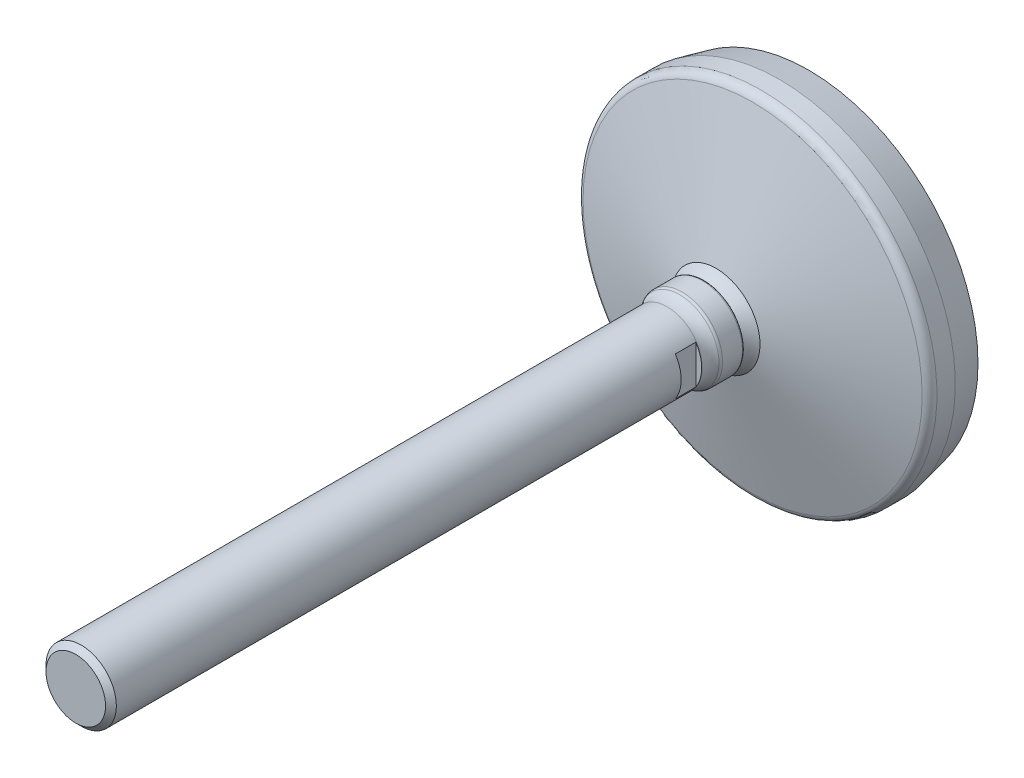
ISO-10303-21;
HEADER;
FILE_DESCRIPTION(('STEP AP214'),'2;1');
FILE_NAME('part.step','',(''),(''),'','','');
FILE_SCHEMA(('AUTOMOTIVE_DESIGN { 1 0 10303 214 1 1 1 1 }'));
ENDSEC;
DATA;
#1=APPLICATION_CONTEXT('core data for automotive mechanical design processes');
#2=APPLICATION_PROTOCOL_DEFINITION('international standard','automotive_design',2000,#1);
#3=PRODUCT_CONTEXT('',#1,'mechanical');
#4=PRODUCT('Part','Part','',(#3));
#5=PRODUCT_RELATED_PRODUCT_CATEGORY('part','',(#4));
#6=PRODUCT_DEFINITION_FORMATION('','',#4);
#7=PRODUCT_DEFINITION_CONTEXT('part definition',#1,'design');
#8=PRODUCT_DEFINITION('design','',#6,#7);
#9=PRODUCT_DEFINITION_SHAPE('','',#8);
#10=(LENGTH_UNIT() NAMED_UNIT(*) SI_UNIT(.MILLI.,.METRE.));
#11=(NAMED_UNIT(*) PLANE_ANGLE_UNIT() SI_UNIT($,.RADIAN.));
#12=(NAMED_UNIT(*) SI_UNIT($,.STERADIAN.) SOLID_ANGLE_UNIT());
#13=UNCERTAINTY_MEASURE_WITH_UNIT(LENGTH_MEASURE(1.E-05),#10,'distance_accuracy_value','');
#14=(GEOMETRIC_REPRESENTATION_CONTEXT(3) GLOBAL_UNCERTAINTY_ASSIGNED_CONTEXT((#13)) GLOBAL_UNIT_ASSIGNED_CONTEXT((#10,
#11,#12)) REPRESENTATION_CONTEXT('',''));
#15=CARTESIAN_POINT('',(0.,0.,0.));
#16=DIRECTION('',(0.,0.,1.));
#17=DIRECTION('',(1.,0.,0.));
#18=AXIS2_PLACEMENT_3D('',#15,#16,#17);
#19=CARTESIAN_POINT('',(0.,0.,40.6420167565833));
#20=DIRECTION('',(0.,0.,-1.));
#21=DIRECTION('',(0.,1.,0.));
#22=AXIS2_PLACEMENT_3D('',#19,#20,#21);
#23=TOROIDAL_SURFACE('',#22,22.8893556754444,12.);
#24=CARTESIAN_POINT('',(0.,0.,31.6));
#25=DIRECTION('',(0.,0.,-1.));
#26=DIRECTION('',(0.,1.,0.));
#27=AXIS2_PLACEMENT_3D('',#24,#25,#26);
#28=CIRCLE('',#27,15.);
#29=CARTESIAN_POINT('',(0.,15.,31.6));
#30=VERTEX_POINT('',#29);
#31=EDGE_CURVE('E86',#30,#30,#28,.T.);
#32=ORIENTED_EDGE('',*,*,#31,.F.);
#33=EDGE_LOOP('',(#32));
#34=FACE_BOUND('',#33,.T.);
#35=CARTESIAN_POINT('',(0.,0.,35.6));
#36=DIRECTION('',(0.,0.,-1.));
#37=DIRECTION('',(0.,1.,0.));
#38=AXIS2_PLACEMENT_3D('',#35,#36,#37);
#39=CIRCLE('',#38,12.);
#40=CARTESIAN_POINT('',(0.,12.,35.6));
#41=VERTEX_POINT('',#40);
#42=EDGE_CURVE('E61',#41,#41,#39,.T.);
#43=ORIENTED_EDGE('',*,*,#42,.T.);
#44=EDGE_LOOP('',(#43));
#45=FACE_BOUND('',#44,.T.);
#46=ADVANCED_FACE('F14',(#34,#45),#23,.F.);
#47=CARTESIAN_POINT('',(0.,0.,31.6));
#48=DIRECTION('',(0.,0.,-1.));
#49=DIRECTION('',(0.,1.,0.));
#50=AXIS2_PLACEMENT_3D('',#47,#48,#49);
#51=CONICAL_SURFACE('',#50,15.,1.2875142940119);
#52=CARTESIAN_POINT('',(0.,0.,19.1292293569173));
#53=DIRECTION('',(0.,0.,-1.));
#54=DIRECTION('',(0.,1.,0.));
#55=AXIS2_PLACEMENT_3D('',#52,#53,#54);
#56=CIRCLE('',#55,57.8385251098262);
#57=CARTESIAN_POINT('',(0.,57.8385251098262,19.1292293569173));
#58=VERTEX_POINT('',#57);
#59=EDGE_CURVE('E89',#58,#58,#56,.T.);
#60=CARTESIAN_POINT('',(0.,57.8385251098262,19.1292293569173));
#61=CARTESIAN_POINT('',(0.,57.3922904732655,19.2591332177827));
#62=CARTESIAN_POINT('',(0.,56.9460558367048,19.3890370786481));
#63=CARTESIAN_POINT('',(0.,56.0535865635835,19.648844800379));
#64=CARTESIAN_POINT('',(0.,55.6073519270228,19.7787486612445));
#65=CARTESIAN_POINT('',(0.,54.7148826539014,20.0385563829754));
#66=CARTESIAN_POINT('',(0.,54.2686480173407,20.1684602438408));
#67=CARTESIAN_POINT('',(0.,53.3761787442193,20.4282679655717));
#68=CARTESIAN_POINT('',(0.,52.9299441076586,20.5581718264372));
#69=CARTESIAN_POINT('',(0.,52.0374748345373,20.817979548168));
#70=CARTESIAN_POINT('',(0.,51.5912401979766,20.9478834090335));
#71=CARTESIAN_POINT('',(0.,50.6987709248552,21.2076911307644));
#72=CARTESIAN_POINT('',(0.,50.2525362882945,21.3375949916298));
#73=CARTESIAN_POINT('',(0.,49.3600670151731,21.5974027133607));
#74=CARTESIAN_POINT('',(0.,48.9138323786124,21.7273065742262));
#75=CARTESIAN_POINT('',(0.,48.021363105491,21.9871142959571));
#76=CARTESIAN_POINT('',(0.,47.5751284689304,22.1170181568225));
#77=CARTESIAN_POINT('',(0.,46.682659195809,22.3768258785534));
#78=CARTESIAN_POINT('',(0.,46.2364245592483,22.5067297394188));
#79=CARTESIAN_POINT('',(0.,45.3439552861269,22.7665374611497));
#80=CARTESIAN_POINT('',(0.,44.8977206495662,22.8964413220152));
#81=CARTESIAN_POINT('',(0.,44.0052513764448,23.1562490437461));
#82=CARTESIAN_POINT('',(0.,43.5590167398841,23.2861529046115));
#83=CARTESIAN_POINT('',(0.,42.6665474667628,23.5459606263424));
#84=CARTESIAN_POINT('',(0.,42.2203128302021,23.6758644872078));
#85=CARTESIAN_POINT('',(0.,41.3278435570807,23.9356722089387));
#86=CARTESIAN_POINT('',(0.,40.88160892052,24.0655760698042));
#87=CARTESIAN_POINT('',(0.,39.9891396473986,24.3253837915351));
#88=CARTESIAN_POINT('',(0.,39.5429050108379,24.4552876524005));
#89=CARTESIAN_POINT('',(0.,38.6504357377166,24.7150953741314));
#90=CARTESIAN_POINT('',(0.,38.2042011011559,24.8449992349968));
#91=CARTESIAN_POINT('',(0.,37.3117318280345,25.1048069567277));
#92=CARTESIAN_POINT('',(0.,36.8654971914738,25.2347108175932));
#93=CARTESIAN_POINT('',(0.,35.9730279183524,25.4945185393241));
#94=CARTESIAN_POINT('',(0.,35.5267932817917,25.6244224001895));
#95=CARTESIAN_POINT('',(0.,34.6343240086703,25.8842301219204));
#96=CARTESIAN_POINT('',(0.,34.1880893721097,26.0141339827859));
#97=CARTESIAN_POINT('',(0.,33.2956200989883,26.2739417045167));
#98=CARTESIAN_POINT('',(0.,32.8493854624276,26.4038455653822));
#99=CARTESIAN_POINT('',(0.,31.9569161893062,26.6636532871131));
#100=CARTESIAN_POINT('',(0.,31.5106815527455,26.7935571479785));
#101=CARTESIAN_POINT('',(0.,30.6182122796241,27.0533648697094));
#102=CARTESIAN_POINT('',(0.,30.1719776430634,27.1832687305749));
#103=CARTESIAN_POINT('',(0.,29.2795083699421,27.4430764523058));
#104=CARTESIAN_POINT('',(0.,28.8332737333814,27.5729803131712));
#105=CARTESIAN_POINT('',(0.,27.94080446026,27.8327880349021));
#106=CARTESIAN_POINT('',(0.,27.4945698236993,27.9626918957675));
#107=CARTESIAN_POINT('',(0.,26.6021005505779,28.2224996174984));
#108=CARTESIAN_POINT('',(0.,26.1558659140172,28.3524034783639));
#109=CARTESIAN_POINT('',(0.,25.2633966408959,28.6122112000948));
#110=CARTESIAN_POINT('',(0.,24.8171620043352,28.7421150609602));
#111=CARTESIAN_POINT('',(0.,23.9246927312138,29.0019227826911));
#112=CARTESIAN_POINT('',(0.,23.4784580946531,29.1318266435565));
#113=CARTESIAN_POINT('',(0.,22.5859888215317,29.3916343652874));
#114=CARTESIAN_POINT('',(0.,22.139754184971,29.5215382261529));
#115=CARTESIAN_POINT('',(0.,21.2472849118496,29.7813459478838));
#116=CARTESIAN_POINT('',(0.,20.801050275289,29.9112498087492));
#117=CARTESIAN_POINT('',(0.,19.9085810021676,30.1710575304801));
#118=CARTESIAN_POINT('',(0.,19.4623463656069,30.3009613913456));
#119=CARTESIAN_POINT('',(0.,18.5698770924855,30.5607691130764));
#120=CARTESIAN_POINT('',(0.,18.1236424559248,30.6906729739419));
#121=CARTESIAN_POINT('',(0.,17.2311731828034,30.9504806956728));
#122=CARTESIAN_POINT('',(0.,16.7849385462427,31.0803845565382));
#123=CARTESIAN_POINT('',(0.,15.8924692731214,31.3401922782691));
#124=CARTESIAN_POINT('',(0.,15.4462346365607,31.4700961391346));
#125=CARTESIAN_POINT('',(0.,15.,31.6));
#126=B_SPLINE_CURVE_WITH_KNOTS('',3,(#60,#61,#62,#63,#64,#65,#66,#67,#68,#69,#70,#71,#72,#73,
#74,#75,#76,#77,#78,#79,#80,#81,#82,#83,#84,#85,#86,#87,#88,#89,#90,#91,#92,#93,#94,#95,#96,#97,
#98,#99,#100,#101,#102,#103,#104,#105,#106,#107,#108,#109,#110,#111,#112,#113,#114,#115,#116,
#117,#118,#119,#120,#121,#122,#123,#124,#125),.UNSPECIFIED.,.F.,.F.,(4,2,2,2,2,2,2,2,2,2,2,2,2,
2,2,2,2,2,2,2,2,2,2,2,2,2,2,2,2,2,2,2,4),(0.,1.39427517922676,2.78855035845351,4.18282553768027,
5.57710071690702,6.97137589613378,8.36565107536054,9.75992625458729,11.154201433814,
12.5484766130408,13.9427517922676,15.3370269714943,16.7313021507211,18.1255773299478,
19.5198525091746,20.9141276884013,22.3084028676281,23.7026780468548,25.0969532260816,
26.4912284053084,27.8855035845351,29.2797787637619,30.6740539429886,32.0683291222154,
33.4626043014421,34.8568794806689,36.2511546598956,37.6454298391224,39.0397050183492,
40.4339801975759,41.8282553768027,43.2225305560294,44.6168057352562),.UNSPECIFIED.);
#127=EDGE_CURVE('BSEAM147',#58,#30,#126,.T.);
#128=ORIENTED_EDGE('',*,*,#59,.F.);
#129=ORIENTED_EDGE('',*,*,#31,.T.);
#130=ORIENTED_EDGE('',*,*,#127,.T.);
#131=ORIENTED_EDGE('',*,*,#127,.F.);
#132=EDGE_LOOP('',(#128,#130,#129,#131));
#133=FACE_BOUND('',#132,.T.);
#134=ADVANCED_FACE('F147',(#133),#51,.T.);
#135=CARTESIAN_POINT('',(0.,0.,16.2487995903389));
#136=DIRECTION('',(0.,0.,-1.));
#137=DIRECTION('',(0.,1.,0.));
#138=AXIS2_PLACEMENT_3D('',#135,#136,#137);
#139=TOROIDAL_SURFACE('',#138,57.,2.99999999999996);
#140=ORIENTED_EDGE('',*,*,#59,.T.);
#141=EDGE_LOOP('',(#140));
#142=FACE_BOUND('',#141,.T.);
#143=CARTESIAN_POINT('',(0.,0.,16.2487995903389));
#144=DIRECTION('',(0.,0.,-1.));
#145=DIRECTION('',(0.,1.,0.));
#146=AXIS2_PLACEMENT_3D('',#143,#144,#145);
#147=CIRCLE('',#146,60.);
#148=CARTESIAN_POINT('',(0.,60.,16.2487995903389));
#149=VERTEX_POINT('',#148);
#150=EDGE_CURVE('E92',#149,#149,#147,.T.);
#151=ORIENTED_EDGE('',*,*,#150,.F.);
#152=EDGE_LOOP('',(#151));
#153=FACE_BOUND('',#152,.T.);
#154=ADVANCED_FACE('F153',(#142,#153),#139,.T.);
#155=CARTESIAN_POINT('',(0.,0.,0.));
#156=DIRECTION('',(0.,0.,-1.));
#157=DIRECTION('',(0.,1.,0.));
#158=AXIS2_PLACEMENT_3D('',#155,#156,#157);
#159=CYLINDRICAL_SURFACE('',#158,60.);
#160=CARTESIAN_POINT('',(0.,0.,10.));
#161=DIRECTION('',(0.,0.,-1.));
#162=DIRECTION('',(0.,1.,0.));
#163=AXIS2_PLACEMENT_3D('',#160,#161,#162);
#164=CIRCLE('',#163,60.);
#165=CARTESIAN_POINT('',(0.,60.,10.));
#166=VERTEX_POINT('',#165);
#167=EDGE_CURVE('E95',#166,#166,#164,.T.);
#168=ORIENTED_EDGE('',*,*,#167,.F.);
#169=EDGE_LOOP('',(#168));
#170=FACE_BOUND('',#169,.T.);
#171=ORIENTED_EDGE('',*,*,#150,.T.);
#172=EDGE_LOOP('',(#171));
#173=FACE_BOUND('',#172,.T.);
#174=ADVANCED_FACE('F198',(#170,#173),#159,.T.);
#175=CARTESIAN_POINT('',(0.,0.,10.));
#176=DIRECTION('',(0.,0.,1.));
#177=DIRECTION('',(0.,-1.,0.));
#178=AXIS2_PLACEMENT_3D('',#175,#176,#177);
#179=CONICAL_SURFACE('',#178,60.,0.221314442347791);
#180=CARTESIAN_POINT('',(0.,0.,0.));
#181=DIRECTION('',(0.,0.,-1.));
#182=DIRECTION('',(0.,1.,0.));
#183=AXIS2_PLACEMENT_3D('',#180,#181,#182);
#184=CIRCLE('',#183,57.75);
#185=CARTESIAN_POINT('',(0.,57.75,0.));
#186=VERTEX_POINT('',#185);
#187=EDGE_CURVE('E98',#186,#186,#184,.T.);
#188=ORIENTED_EDGE('',*,*,#187,.F.);
#189=EDGE_LOOP('',(#188));
#190=FACE_BOUND('',#189,.T.);
#191=ORIENTED_EDGE('',*,*,#167,.T.);
#192=EDGE_LOOP('',(#191));
#193=FACE_BOUND('',#192,.T.);
#194=ADVANCED_FACE('F194',(#190,#193),#179,.T.);
#195=CARTESIAN_POINT('',(57.75,0.,0.));
#196=DIRECTION('',(0.,0.,1.));
#197=DIRECTION('',(0.,-1.,0.));
#198=AXIS2_PLACEMENT_3D('',#195,#196,#197);
#199=PLANE('',#198);
#200=ORIENTED_EDGE('',*,*,#187,.T.);
#201=EDGE_LOOP('',(#200));
#202=FACE_BOUND('',#201,.T.);
#203=ADVANCED_FACE('F187',(#202),#199,.F.);
#204=CARTESIAN_POINT('',(0.,0.,16.));
#205=DIRECTION('',(0.,0.,-1.));
#206=DIRECTION('',(0.,1.,0.));
#207=AXIS2_PLACEMENT_3D('',#204,#205,#206);
#208=CYLINDRICAL_SURFACE('',#207,12.);
#209=CARTESIAN_POINT('',(0.,0.,48.3));
#210=DIRECTION('',(0.,0.,-1.));
#211=DIRECTION('',(0.,1.,0.));
#212=AXIS2_PLACEMENT_3D('',#209,#210,#211);
#213=CIRCLE('',#212,12.);
#214=CARTESIAN_POINT('',(0.,12.,48.3));
#215=VERTEX_POINT('',#214);
#216=EDGE_CURVE('E107',#215,#215,#213,.T.);
#217=ORIENTED_EDGE('',*,*,#216,.F.);
#218=EDGE_LOOP('',(#217));
#219=FACE_BOUND('',#218,.T.);
#220=DIRECTION('',(0.,0.,-1.));
#221=VECTOR('',#220,1.);
#222=CARTESIAN_POINT('',(10.,-6.6332495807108,16.));
#223=LINE('',#222,#221);
#224=CARTESIAN_POINT('',(10.,-6.6332495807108,48.5));
#225=VERTEX_POINT('',#224);
#226=CARTESIAN_POINT('',(10.,-6.6332495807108,55.5));
#227=VERTEX_POINT('',#226);
#228=EDGE_CURVE('E77',#225,#227,#223,.F.);
#229=ORIENTED_EDGE('',*,*,#228,.T.);
#230=CARTESIAN_POINT('',(0.,0.,55.5));
#231=DIRECTION('',(0.,0.,1.));
#232=DIRECTION('',(0.,-1.,0.));
#233=AXIS2_PLACEMENT_3D('',#230,#231,#232);
#234=CIRCLE('',#233,12.);
#235=CARTESIAN_POINT('',(10.,6.6332495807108,55.5));
#236=VERTEX_POINT('',#235);
#237=EDGE_CURVE('E9',#227,#236,#234,.T.);
#238=ORIENTED_EDGE('',*,*,#237,.T.);
#239=DIRECTION('',(0.,0.,-1.));
#240=VECTOR('',#239,1.);
#241=CARTESIAN_POINT('',(10.,6.6332495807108,16.));
#242=LINE('',#241,#240);
#243=CARTESIAN_POINT('',(10.,6.6332495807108,48.5));
#244=VERTEX_POINT('',#243);
#245=EDGE_CURVE('E17',#236,#244,#242,.T.);
#246=ORIENTED_EDGE('',*,*,#245,.T.);
#247=CARTESIAN_POINT('',(0.,0.,48.5));
#248=DIRECTION('',(0.,0.,1.));
#249=DIRECTION('',(0.,-1.,0.));
#250=AXIS2_PLACEMENT_3D('',#247,#248,#249);
#251=CIRCLE('',#250,12.);
#252=EDGE_CURVE('E63',#225,#244,#251,.T.);
#253=ORIENTED_EDGE('',*,*,#252,.F.);
#254=EDGE_LOOP('',(#229,#238,#246,#253));
#255=FACE_BOUND('',#254,.T.);
#256=DIRECTION('',(0.,0.,-1.));
#257=VECTOR('',#256,1.);
#258=CARTESIAN_POINT('',(-10.,6.6332495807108,16.));
#259=LINE('',#258,#257);
#260=CARTESIAN_POINT('',(-10.,6.6332495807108,48.5));
#261=VERTEX_POINT('',#260);
#262=CARTESIAN_POINT('',(-10.,6.6332495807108,55.5));
#263=VERTEX_POINT('',#262);
#264=EDGE_CURVE('E60',#261,#263,#259,.F.);
#265=ORIENTED_EDGE('',*,*,#264,.T.);
#266=CARTESIAN_POINT('',(-10.,-6.6332495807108,55.5));
#267=VERTEX_POINT('',#266);
#268=EDGE_CURVE('E23',#263,#267,#234,.T.);
#269=ORIENTED_EDGE('',*,*,#268,.T.);
#270=DIRECTION('',(0.,0.,-1.));
#271=VECTOR('',#270,1.);
#272=CARTESIAN_POINT('',(-10.,-6.6332495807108,16.));
#273=LINE('',#272,#271);
#274=CARTESIAN_POINT('',(-10.,-6.6332495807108,48.5));
#275=VERTEX_POINT('',#274);
#276=EDGE_CURVE('E67',#267,#275,#273,.T.);
#277=ORIENTED_EDGE('',*,*,#276,.T.);
#278=EDGE_CURVE('E55',#261,#275,#251,.T.);
#279=ORIENTED_EDGE('',*,*,#278,.F.);
#280=EDGE_LOOP('',(#265,#269,#277,#279));
#281=FACE_BOUND('',#280,.T.);
#282=CARTESIAN_POINT('',(0.,0.,248.1595));
#283=DIRECTION('',(0.,0.,-1.));
#284=DIRECTION('',(0.,1.,0.));
#285=AXIS2_PLACEMENT_3D('',#282,#283,#284);
#286=CIRCLE('',#285,12.);
#287=CARTESIAN_POINT('',(0.,12.,248.1595));
#288=VERTEX_POINT('',#287);
#289=EDGE_CURVE('E104',#288,#288,#286,.T.);
#290=ORIENTED_EDGE('',*,*,#289,.T.);
#291=EDGE_LOOP('',(#290));
#292=FACE_BOUND('',#291,.T.);
#293=ADVANCED_FACE('F73',(#219,#255,#281,#292),#208,.T.);
#294=CARTESIAN_POINT('',(0.,0.,48.3));
#295=DIRECTION('',(0.,0.,-1.));
#296=DIRECTION('',(0.,1.,0.));
#297=AXIS2_PLACEMENT_3D('',#294,#295,#296);
#298=TOROIDAL_SURFACE('',#297,19.,7.);
#299=CARTESIAN_POINT('',(0.,0.,44.0456515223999));
#300=DIRECTION('',(0.,0.,-1.));
#301=DIRECTION('',(0.,1.,0.));
#302=AXIS2_PLACEMENT_3D('',#299,#300,#301);
#303=CIRCLE('',#302,13.4411764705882);
#304=CARTESIAN_POINT('',(0.,13.4411764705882,44.0456515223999));
#305=VERTEX_POINT('',#304);
#306=EDGE_CURVE('E110',#305,#305,#303,.T.);
#307=ORIENTED_EDGE('',*,*,#306,.F.);
#308=EDGE_LOOP('',(#307));
#309=FACE_BOUND('',#308,.T.);
#310=ORIENTED_EDGE('',*,*,#216,.T.);
#311=EDGE_LOOP('',(#310));
#312=FACE_BOUND('',#311,.T.);
#313=ADVANCED_FACE('F180',(#309,#312),#298,.F.);
#314=CARTESIAN_POINT('',(0.,0.,43.1340054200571));
#315=DIRECTION('',(0.,0.,-1.));
#316=DIRECTION('',(0.,1.,0.));
#317=AXIS2_PLACEMENT_3D('',#314,#315,#316);
#318=TOROIDAL_SURFACE('',#317,12.25,1.5);
#319=ORIENTED_EDGE('',*,*,#306,.T.);
#320=EDGE_LOOP('',(#319));
#321=FACE_BOUND('',#320,.T.);
#322=CARTESIAN_POINT('',(0.,0.,43.1340054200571));
#323=DIRECTION('',(0.,0.,-1.));
#324=DIRECTION('',(0.,1.,0.));
#325=AXIS2_PLACEMENT_3D('',#322,#323,#324);
#326=CIRCLE('',#325,13.75);
#327=CARTESIAN_POINT('',(0.,13.75,43.1340054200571));
#328=VERTEX_POINT('',#327);
#329=EDGE_CURVE('E113',#328,#328,#326,.T.);
#330=ORIENTED_EDGE('',*,*,#329,.F.);
#331=EDGE_LOOP('',(#330));
#332=FACE_BOUND('',#331,.T.);
#333=ADVANCED_FACE('F173',(#321,#332),#318,.T.);
#334=CARTESIAN_POINT('',(0.,0.,16.));
#335=DIRECTION('',(0.,0.,-1.));
#336=DIRECTION('',(0.,1.,0.));
#337=AXIS2_PLACEMENT_3D('',#334,#335,#336);
#338=CYLINDRICAL_SURFACE('',#337,13.75);
#339=CARTESIAN_POINT('',(0.,0.,36.35));
#340=DIRECTION('',(0.,0.,-1.));
#341=DIRECTION('',(0.,1.,0.));
#342=AXIS2_PLACEMENT_3D('',#339,#340,#341);
#343=CIRCLE('',#342,13.75);
#344=CARTESIAN_POINT('',(0.,13.75,36.35));
#345=VERTEX_POINT('',#344);
#346=EDGE_CURVE('E116',#345,#345,#343,.T.);
#347=ORIENTED_EDGE('',*,*,#346,.F.);
#348=EDGE_LOOP('',(#347));
#349=FACE_BOUND('',#348,.T.);
#350=ORIENTED_EDGE('',*,*,#329,.T.);
#351=EDGE_LOOP('',(#350));
#352=FACE_BOUND('',#351,.T.);
#353=ADVANCED_FACE('F166',(#349,#352),#338,.T.);
#354=CARTESIAN_POINT('',(0.,0.,36.35));
#355=DIRECTION('',(0.,0.,-1.));
#356=DIRECTION('',(0.,1.,0.));
#357=AXIS2_PLACEMENT_3D('',#354,#355,#356);
#358=TOROIDAL_SURFACE('',#357,13.,0.75);
#359=ORIENTED_EDGE('',*,*,#346,.T.);
#360=EDGE_LOOP('',(#359));
#361=FACE_BOUND('',#360,.T.);
#362=CARTESIAN_POINT('',(0.,0.,35.6));
#363=DIRECTION('',(0.,0.,-1.));
#364=DIRECTION('',(0.,1.,0.));
#365=AXIS2_PLACEMENT_3D('',#362,#363,#364);
#366=CIRCLE('',#365,13.);
#367=CARTESIAN_POINT('',(0.,13.,35.6));
#368=VERTEX_POINT('',#367);
#369=EDGE_CURVE('E119',#368,#368,#366,.T.);
#370=ORIENTED_EDGE('',*,*,#369,.F.);
#371=EDGE_LOOP('',(#370));
#372=FACE_BOUND('',#371,.T.);
#373=ADVANCED_FACE('F161',(#361,#372),#358,.T.);
#374=CARTESIAN_POINT('',(13.,0.,35.6));
#375=DIRECTION('',(0.,0.,1.));
#376=DIRECTION('',(0.,-1.,0.));
#377=AXIS2_PLACEMENT_3D('',#374,#375,#376);
#378=PLANE('',#377);
#379=ORIENTED_EDGE('',*,*,#42,.F.);
#380=EDGE_LOOP('',(#379));
#381=FACE_BOUND('',#380,.T.);
#382=ORIENTED_EDGE('',*,*,#369,.T.);
#383=EDGE_LOOP('',(#382));
#384=FACE_BOUND('',#383,.T.);
#385=ADVANCED_FACE('F145',(#381,#384),#378,.F.);
#386=CARTESIAN_POINT('',(0.,0.,48.5));
#387=DIRECTION('',(0.,0.,1.));
#388=DIRECTION('',(0.,-1.,0.));
#389=AXIS2_PLACEMENT_3D('',#386,#387,#388);
#390=PLANE('',#389);
#391=ORIENTED_EDGE('',*,*,#278,.T.);
#392=DIRECTION('',(0.,-1.,0.));
#393=VECTOR('',#392,1.);
#394=CARTESIAN_POINT('',(-10.,24.,48.5));
#395=LINE('',#394,#393);
#396=EDGE_CURVE('E29',#261,#275,#395,.T.);
#397=ORIENTED_EDGE('',*,*,#396,.F.);
#398=EDGE_LOOP('',(#391,#397));
#399=FACE_BOUND('',#398,.T.);
#400=ADVANCED_FACE('F56',(#399),#390,.T.);
#401=CARTESIAN_POINT('',(0.,0.,55.5));
#402=DIRECTION('',(0.,0.,1.));
#403=DIRECTION('',(0.,-1.,0.));
#404=AXIS2_PLACEMENT_3D('',#401,#402,#403);
#405=PLANE('',#404);
#406=DIRECTION('',(0.,-1.,0.));
#407=VECTOR('',#406,1.);
#408=CARTESIAN_POINT('',(-10.,24.,55.5));
#409=LINE('',#408,#407);
#410=EDGE_CURVE('E121',#263,#267,#409,.T.);
#411=ORIENTED_EDGE('',*,*,#410,.T.);
#412=ORIENTED_EDGE('',*,*,#268,.F.);
#413=EDGE_LOOP('',(#411,#412));
#414=FACE_BOUND('',#413,.T.);
#415=ADVANCED_FACE('F142',(#414),#405,.F.);
#416=CARTESIAN_POINT('',(-10.,24.,55.5));
#417=DIRECTION('',(1.,0.,0.));
#418=DIRECTION('',(0.,1.,0.));
#419=AXIS2_PLACEMENT_3D('',#416,#417,#418);
#420=PLANE('',#419);
#421=ORIENTED_EDGE('',*,*,#410,.F.);
#422=ORIENTED_EDGE('',*,*,#264,.F.);
#423=ORIENTED_EDGE('',*,*,#396,.T.);
#424=ORIENTED_EDGE('',*,*,#276,.F.);
#425=EDGE_LOOP('',(#421,#422,#423,#424));
#426=FACE_BOUND('',#425,.T.);
#427=ADVANCED_FACE('F66',(#426),#420,.F.);
#428=CARTESIAN_POINT('',(10.,-24.,55.5));
#429=DIRECTION('',(-1.,0.,0.));
#430=DIRECTION('',(0.,-1.,0.));
#431=AXIS2_PLACEMENT_3D('',#428,#429,#430);
#432=PLANE('',#431);
#433=DIRECTION('',(0.,1.,0.));
#434=VECTOR('',#433,1.);
#435=CARTESIAN_POINT('',(10.,-24.,55.5));
#436=LINE('',#435,#434);
#437=EDGE_CURVE('E69',#227,#236,#436,.T.);
#438=ORIENTED_EDGE('',*,*,#437,.F.);
#439=ORIENTED_EDGE('',*,*,#228,.F.);
#440=DIRECTION('',(0.,1.,0.));
#441=VECTOR('',#440,1.);
#442=CARTESIAN_POINT('',(10.,-24.,48.5));
#443=LINE('',#442,#441);
#444=EDGE_CURVE('E70',#225,#244,#443,.T.);
#445=ORIENTED_EDGE('',*,*,#444,.T.);
#446=ORIENTED_EDGE('',*,*,#245,.F.);
#447=EDGE_LOOP('',(#438,#439,#445,#446));
#448=FACE_BOUND('',#447,.T.);
#449=ADVANCED_FACE('F127',(#448),#432,.F.);
#450=ORIENTED_EDGE('',*,*,#437,.T.);
#451=ORIENTED_EDGE('',*,*,#237,.F.);
#452=EDGE_LOOP('',(#450,#451));
#453=FACE_BOUND('',#452,.T.);
#454=ADVANCED_FACE('F126',(#453),#405,.F.);
#455=ORIENTED_EDGE('',*,*,#444,.F.);
#456=ORIENTED_EDGE('',*,*,#252,.T.);
#457=EDGE_LOOP('',(#455,#456));
#458=FACE_BOUND('',#457,.T.);
#459=ADVANCED_FACE('F128',(#458),#390,.T.);
#460=CARTESIAN_POINT('',(0.,0.,250.));
#461=DIRECTION('',(0.,0.,-1.));
#462=DIRECTION('',(0.,1.,0.));
#463=AXIS2_PLACEMENT_3D('',#460,#461,#462);
#464=PLANE('',#463);
#465=CARTESIAN_POINT('',(0.,0.,250.));
#466=DIRECTION('',(0.,0.,-1.));
#467=DIRECTION('',(0.,1.,0.));
#468=AXIS2_PLACEMENT_3D('',#465,#466,#467);
#469=CIRCLE('',#468,10.1595);
#470=CARTESIAN_POINT('',(0.,10.1595,250.));
#471=VERTEX_POINT('',#470);
#472=EDGE_CURVE('E101',#471,#471,#469,.T.);
#473=ORIENTED_EDGE('',*,*,#472,.F.);
#474=EDGE_LOOP('',(#473));
#475=FACE_BOUND('',#474,.T.);
#476=ADVANCED_FACE('F130',(#475),#464,.F.);
#477=CARTESIAN_POINT('',(0.,0.,250.));
#478=DIRECTION('',(0.,0.,-1.));
#479=DIRECTION('',(0.,1.,0.));
#480=AXIS2_PLACEMENT_3D('',#477,#478,#479);
#481=CONICAL_SURFACE('',#480,10.1595,0.785398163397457);
#482=ORIENTED_EDGE('',*,*,#289,.F.);
#483=EDGE_LOOP('',(#482));
#484=FACE_BOUND('',#483,.T.);
#485=ORIENTED_EDGE('',*,*,#472,.T.);
#486=EDGE_LOOP('',(#485));
#487=FACE_BOUND('',#486,.T.);
#488=ADVANCED_FACE('F138',(#484,#487),#481,.T.);
#489=CLOSED_SHELL('',(#46,#134,#154,#174,#194,#203,#293,#313,#333,#353,#373,#385,#400,#415,#427,
#449,#454,#459,#476,#488));
#490=MANIFOLD_SOLID_BREP('B1',#489);
#491=ADVANCED_BREP_SHAPE_REPRESENTATION('',(#18,#490),#14);
#492=SHAPE_DEFINITION_REPRESENTATION(#9,#491);
ENDSEC;
END-ISO-10303-21;
